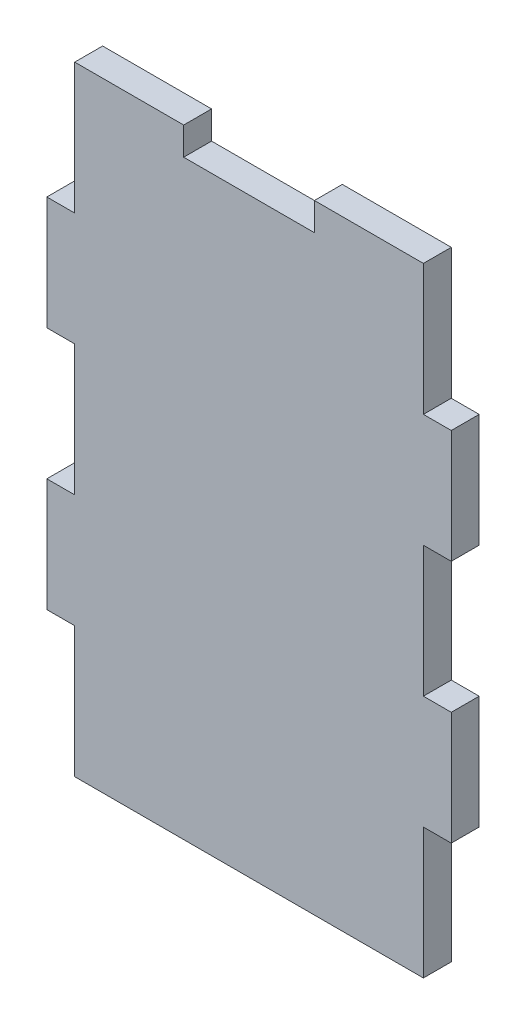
ISO-10303-21;
HEADER;
FILE_DESCRIPTION(('STEP AP214'),'2;1');
FILE_NAME('part.step','',(''),(''),'','','');
FILE_SCHEMA(('AUTOMOTIVE_DESIGN { 1 0 10303 214 1 1 1 1 }'));
ENDSEC;
DATA;
#1=APPLICATION_CONTEXT('core data for automotive mechanical design processes');
#2=APPLICATION_PROTOCOL_DEFINITION('international standard','automotive_design',2000,#1);
#3=PRODUCT_CONTEXT('',#1,'mechanical');
#4=PRODUCT('Part','Part','',(#3));
#5=PRODUCT_RELATED_PRODUCT_CATEGORY('part','',(#4));
#6=PRODUCT_DEFINITION_FORMATION('','',#4);
#7=PRODUCT_DEFINITION_CONTEXT('part definition',#1,'design');
#8=PRODUCT_DEFINITION('design','',#6,#7);
#9=PRODUCT_DEFINITION_SHAPE('','',#8);
#10=(LENGTH_UNIT() NAMED_UNIT(*) SI_UNIT(.MILLI.,.METRE.));
#11=(NAMED_UNIT(*) PLANE_ANGLE_UNIT() SI_UNIT($,.RADIAN.));
#12=(NAMED_UNIT(*) SI_UNIT($,.STERADIAN.) SOLID_ANGLE_UNIT());
#13=UNCERTAINTY_MEASURE_WITH_UNIT(LENGTH_MEASURE(1.E-05),#10,'distance_accuracy_value','');
#14=(GEOMETRIC_REPRESENTATION_CONTEXT(3) GLOBAL_UNCERTAINTY_ASSIGNED_CONTEXT((#13)) GLOBAL_UNIT_ASSIGNED_CONTEXT((#10,
#11,#12)) REPRESENTATION_CONTEXT('',''));
#15=CARTESIAN_POINT('',(0.,0.,0.));
#16=DIRECTION('',(0.,0.,1.));
#17=DIRECTION('',(1.,0.,0.));
#18=AXIS2_PLACEMENT_3D('',#15,#16,#17);
#19=CARTESIAN_POINT('',(0.,355.,16.));
#20=DIRECTION('',(0.,1.,0.));
#21=DIRECTION('',(0.,0.,1.));
#22=AXIS2_PLACEMENT_3D('',#19,#20,#21);
#23=PLANE('',#22);
#24=DIRECTION('',(1.,0.,0.));
#25=VECTOR('',#24,1.);
#26=CARTESIAN_POINT('',(0.,355.,0.));
#27=LINE('',#26,#25);
#28=CARTESIAN_POINT('',(153.5,355.,0.));
#29=VERTEX_POINT('',#28);
#30=CARTESIAN_POINT('',(216.,355.,0.));
#31=VERTEX_POINT('',#30);
#32=EDGE_CURVE('E229',#29,#31,#27,.T.);
#33=ORIENTED_EDGE('',*,*,#32,.F.);
#34=DIRECTION('',(0.,0.,-1.));
#35=VECTOR('',#34,1.);
#36=CARTESIAN_POINT('',(153.5,355.,16.));
#37=LINE('',#36,#35);
#38=CARTESIAN_POINT('',(153.5,355.,16.));
#39=VERTEX_POINT('',#38);
#40=EDGE_CURVE('E11',#39,#29,#37,.T.);
#41=ORIENTED_EDGE('',*,*,#40,.F.);
#42=DIRECTION('',(1.,0.,0.));
#43=VECTOR('',#42,1.);
#44=CARTESIAN_POINT('',(0.,355.,16.));
#45=LINE('',#44,#43);
#46=CARTESIAN_POINT('',(216.,355.,16.));
#47=VERTEX_POINT('',#46);
#48=EDGE_CURVE('E289',#39,#47,#45,.T.);
#49=ORIENTED_EDGE('',*,*,#48,.T.);
#50=DIRECTION('',(0.,0.,-1.));
#51=VECTOR('',#50,1.);
#52=CARTESIAN_POINT('',(216.,355.,16.));
#53=LINE('',#52,#51);
#54=EDGE_CURVE('E53',#47,#31,#53,.T.);
#55=ORIENTED_EDGE('',*,*,#54,.T.);
#56=EDGE_LOOP('',(#33,#41,#49,#55));
#57=FACE_BOUND('',#56,.T.);
#58=ADVANCED_FACE('F36',(#57),#23,.T.);
#59=CARTESIAN_POINT('',(153.499999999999,-2.66280053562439E-13,16.));
#60=DIRECTION('',(1.,0.,0.));
#61=DIRECTION('',(0.,1.,0.));
#62=AXIS2_PLACEMENT_3D('',#59,#60,#61);
#63=PLANE('',#62);
#64=DIRECTION('',(0.,-1.,0.));
#65=VECTOR('',#64,1.);
#66=CARTESIAN_POINT('',(153.499999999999,-2.66280053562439E-13,0.));
#67=LINE('',#66,#65);
#68=CARTESIAN_POINT('',(153.5,339.,0.));
#69=VERTEX_POINT('',#68);
#70=EDGE_CURVE('E231',#29,#69,#67,.T.);
#71=ORIENTED_EDGE('',*,*,#70,.T.);
#72=DIRECTION('',(0.,0.,-1.));
#73=VECTOR('',#72,1.);
#74=CARTESIAN_POINT('',(153.5,339.,16.));
#75=LINE('',#74,#73);
#76=CARTESIAN_POINT('',(153.5,339.,16.));
#77=VERTEX_POINT('',#76);
#78=EDGE_CURVE('E45',#77,#69,#75,.T.);
#79=ORIENTED_EDGE('',*,*,#78,.F.);
#80=DIRECTION('',(0.,-1.,0.));
#81=VECTOR('',#80,1.);
#82=CARTESIAN_POINT('',(153.499999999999,-2.66280053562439E-13,16.));
#83=LINE('',#82,#81);
#84=EDGE_CURVE('E353',#39,#77,#83,.T.);
#85=ORIENTED_EDGE('',*,*,#84,.F.);
#86=ORIENTED_EDGE('',*,*,#40,.T.);
#87=EDGE_LOOP('',(#71,#79,#85,#86));
#88=FACE_BOUND('',#87,.T.);
#89=ADVANCED_FACE('F38',(#88),#63,.F.);
#90=CARTESIAN_POINT('',(0.,339.,16.));
#91=DIRECTION('',(0.,1.,0.));
#92=DIRECTION('',(0.,0.,1.));
#93=AXIS2_PLACEMENT_3D('',#90,#91,#92);
#94=PLANE('',#93);
#95=DIRECTION('',(1.,0.,0.));
#96=VECTOR('',#95,1.);
#97=CARTESIAN_POINT('',(0.,339.,0.));
#98=LINE('',#97,#96);
#99=CARTESIAN_POINT('',(78.5,339.,0.));
#100=VERTEX_POINT('',#99);
#101=EDGE_CURVE('E235',#100,#69,#98,.T.);
#102=ORIENTED_EDGE('',*,*,#101,.F.);
#103=DIRECTION('',(0.,0.,-1.));
#104=VECTOR('',#103,1.);
#105=CARTESIAN_POINT('',(78.5,339.,16.));
#106=LINE('',#105,#104);
#107=CARTESIAN_POINT('',(78.5,339.,16.));
#108=VERTEX_POINT('',#107);
#109=EDGE_CURVE('E330',#108,#100,#106,.T.);
#110=ORIENTED_EDGE('',*,*,#109,.F.);
#111=DIRECTION('',(1.,0.,0.));
#112=VECTOR('',#111,1.);
#113=CARTESIAN_POINT('',(0.,339.,16.));
#114=LINE('',#113,#112);
#115=EDGE_CURVE('E337',#108,#77,#114,.T.);
#116=ORIENTED_EDGE('',*,*,#115,.T.);
#117=ORIENTED_EDGE('',*,*,#78,.T.);
#118=EDGE_LOOP('',(#102,#110,#116,#117));
#119=FACE_BOUND('',#118,.T.);
#120=ADVANCED_FACE('F335',(#119),#94,.T.);
#121=CARTESIAN_POINT('',(78.5,0.,16.));
#122=DIRECTION('',(1.,0.,0.));
#123=DIRECTION('',(0.,0.,-1.));
#124=AXIS2_PLACEMENT_3D('',#121,#122,#123);
#125=PLANE('',#124);
#126=DIRECTION('',(0.,-1.,0.));
#127=VECTOR('',#126,1.);
#128=CARTESIAN_POINT('',(78.5,0.,0.));
#129=LINE('',#128,#127);
#130=CARTESIAN_POINT('',(78.5,355.,0.));
#131=VERTEX_POINT('',#130);
#132=EDGE_CURVE('E238',#131,#100,#129,.T.);
#133=ORIENTED_EDGE('',*,*,#132,.F.);
#134=DIRECTION('',(0.,0.,-1.));
#135=VECTOR('',#134,1.);
#136=CARTESIAN_POINT('',(78.5,355.,16.));
#137=LINE('',#136,#135);
#138=CARTESIAN_POINT('',(78.5,355.,16.));
#139=VERTEX_POINT('',#138);
#140=EDGE_CURVE('E328',#139,#131,#137,.T.);
#141=ORIENTED_EDGE('',*,*,#140,.F.);
#142=DIRECTION('',(0.,-1.,0.));
#143=VECTOR('',#142,1.);
#144=CARTESIAN_POINT('',(78.5,0.,16.));
#145=LINE('',#144,#143);
#146=EDGE_CURVE('E350',#139,#108,#145,.T.);
#147=ORIENTED_EDGE('',*,*,#146,.T.);
#148=ORIENTED_EDGE('',*,*,#109,.T.);
#149=EDGE_LOOP('',(#133,#141,#147,#148));
#150=FACE_BOUND('',#149,.T.);
#151=ADVANCED_FACE('F347',(#150),#125,.T.);
#152=CARTESIAN_POINT('',(16.,355.,0.));
#153=VERTEX_POINT('',#152);
#154=EDGE_CURVE('E232',#153,#131,#27,.T.);
#155=ORIENTED_EDGE('',*,*,#154,.F.);
#156=DIRECTION('',(0.,0.,-1.));
#157=VECTOR('',#156,1.);
#158=CARTESIAN_POINT('',(16.,355.,16.));
#159=LINE('',#158,#157);
#160=CARTESIAN_POINT('',(16.,355.,16.));
#161=VERTEX_POINT('',#160);
#162=EDGE_CURVE('E326',#161,#153,#159,.T.);
#163=ORIENTED_EDGE('',*,*,#162,.F.);
#164=EDGE_CURVE('E355',#161,#139,#45,.T.);
#165=ORIENTED_EDGE('',*,*,#164,.T.);
#166=ORIENTED_EDGE('',*,*,#140,.T.);
#167=EDGE_LOOP('',(#155,#163,#165,#166));
#168=FACE_BOUND('',#167,.T.);
#169=ADVANCED_FACE('F408',(#168),#23,.T.);
#170=CARTESIAN_POINT('',(16.,0.,16.));
#171=DIRECTION('',(1.,0.,0.));
#172=DIRECTION('',(0.,1.,0.));
#173=AXIS2_PLACEMENT_3D('',#170,#171,#172);
#174=PLANE('',#173);
#175=DIRECTION('',(0.,-1.,0.));
#176=VECTOR('',#175,1.);
#177=CARTESIAN_POINT('',(16.,0.,0.));
#178=LINE('',#177,#176);
#179=CARTESIAN_POINT('',(16.,280.,0.));
#180=VERTEX_POINT('',#179);
#181=EDGE_CURVE('E241',#153,#180,#178,.T.);
#182=ORIENTED_EDGE('',*,*,#181,.T.);
#183=DIRECTION('',(0.,0.,-1.));
#184=VECTOR('',#183,1.);
#185=CARTESIAN_POINT('',(16.,280.,16.));
#186=LINE('',#185,#184);
#187=CARTESIAN_POINT('',(16.,280.,16.));
#188=VERTEX_POINT('',#187);
#189=EDGE_CURVE('E324',#188,#180,#186,.T.);
#190=ORIENTED_EDGE('',*,*,#189,.F.);
#191=DIRECTION('',(0.,-1.,0.));
#192=VECTOR('',#191,1.);
#193=CARTESIAN_POINT('',(16.,0.,16.));
#194=LINE('',#193,#192);
#195=EDGE_CURVE('E360',#161,#188,#194,.T.);
#196=ORIENTED_EDGE('',*,*,#195,.F.);
#197=ORIENTED_EDGE('',*,*,#162,.T.);
#198=EDGE_LOOP('',(#182,#190,#196,#197));
#199=FACE_BOUND('',#198,.T.);
#200=ADVANCED_FACE('F415',(#199),#174,.F.);
#201=CARTESIAN_POINT('',(0.,280.,16.));
#202=DIRECTION('',(0.,1.,0.));
#203=DIRECTION('',(0.,0.,1.));
#204=AXIS2_PLACEMENT_3D('',#201,#202,#203);
#205=PLANE('',#204);
#206=DIRECTION('',(1.,0.,0.));
#207=VECTOR('',#206,1.);
#208=CARTESIAN_POINT('',(0.,280.,0.));
#209=LINE('',#208,#207);
#210=CARTESIAN_POINT('',(0.,280.,0.));
#211=VERTEX_POINT('',#210);
#212=EDGE_CURVE('E244',#211,#180,#209,.T.);
#213=ORIENTED_EDGE('',*,*,#212,.F.);
#214=DIRECTION('',(0.,0.,-1.));
#215=VECTOR('',#214,1.);
#216=CARTESIAN_POINT('',(0.,280.,16.));
#217=LINE('',#216,#215);
#218=CARTESIAN_POINT('',(0.,280.,16.));
#219=VERTEX_POINT('',#218);
#220=EDGE_CURVE('E322',#219,#211,#217,.T.);
#221=ORIENTED_EDGE('',*,*,#220,.F.);
#222=DIRECTION('',(1.,0.,0.));
#223=VECTOR('',#222,1.);
#224=CARTESIAN_POINT('',(0.,280.,16.));
#225=LINE('',#224,#223);
#226=EDGE_CURVE('E362',#219,#188,#225,.T.);
#227=ORIENTED_EDGE('',*,*,#226,.T.);
#228=ORIENTED_EDGE('',*,*,#189,.T.);
#229=EDGE_LOOP('',(#213,#221,#227,#228));
#230=FACE_BOUND('',#229,.T.);
#231=ADVANCED_FACE('F421',(#230),#205,.T.);
#232=CARTESIAN_POINT('',(0.,0.,16.));
#233=DIRECTION('',(-1.,0.,0.));
#234=DIRECTION('',(0.,0.,1.));
#235=AXIS2_PLACEMENT_3D('',#232,#233,#234);
#236=PLANE('',#235);
#237=DIRECTION('',(0.,1.,0.));
#238=VECTOR('',#237,1.);
#239=CARTESIAN_POINT('',(0.,0.,0.));
#240=LINE('',#239,#238);
#241=CARTESIAN_POINT('',(0.,215.,0.));
#242=VERTEX_POINT('',#241);
#243=EDGE_CURVE('E247',#242,#211,#240,.T.);
#244=ORIENTED_EDGE('',*,*,#243,.F.);
#245=DIRECTION('',(0.,0.,-1.));
#246=VECTOR('',#245,1.);
#247=CARTESIAN_POINT('',(0.,215.,16.));
#248=LINE('',#247,#246);
#249=CARTESIAN_POINT('',(0.,215.,16.));
#250=VERTEX_POINT('',#249);
#251=EDGE_CURVE('E320',#250,#242,#248,.T.);
#252=ORIENTED_EDGE('',*,*,#251,.F.);
#253=DIRECTION('',(0.,1.,0.));
#254=VECTOR('',#253,1.);
#255=CARTESIAN_POINT('',(0.,0.,16.));
#256=LINE('',#255,#254);
#257=EDGE_CURVE('E365',#250,#219,#256,.T.);
#258=ORIENTED_EDGE('',*,*,#257,.T.);
#259=ORIENTED_EDGE('',*,*,#220,.T.);
#260=EDGE_LOOP('',(#244,#252,#258,#259));
#261=FACE_BOUND('',#260,.T.);
#262=ADVANCED_FACE('F431',(#261),#236,.T.);
#263=CARTESIAN_POINT('',(3.72965547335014E-13,215.,16.));
#264=DIRECTION('',(0.,1.,0.));
#265=DIRECTION('',(-1.,0.,0.));
#266=AXIS2_PLACEMENT_3D('',#263,#264,#265);
#267=PLANE('',#266);
#268=DIRECTION('',(1.,0.,0.));
#269=VECTOR('',#268,1.);
#270=CARTESIAN_POINT('',(3.72965547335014E-13,215.,0.));
#271=LINE('',#270,#269);
#272=CARTESIAN_POINT('',(16.,215.,0.));
#273=VERTEX_POINT('',#272);
#274=EDGE_CURVE('E250',#242,#273,#271,.T.);
#275=ORIENTED_EDGE('',*,*,#274,.T.);
#276=DIRECTION('',(0.,0.,-1.));
#277=VECTOR('',#276,1.);
#278=CARTESIAN_POINT('',(16.,215.,16.));
#279=LINE('',#278,#277);
#280=CARTESIAN_POINT('',(16.,215.,16.));
#281=VERTEX_POINT('',#280);
#282=EDGE_CURVE('E317',#281,#273,#279,.T.);
#283=ORIENTED_EDGE('',*,*,#282,.F.);
#284=DIRECTION('',(1.,0.,0.));
#285=VECTOR('',#284,1.);
#286=CARTESIAN_POINT('',(3.72965547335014E-13,215.,16.));
#287=LINE('',#286,#285);
#288=EDGE_CURVE('E368',#250,#281,#287,.T.);
#289=ORIENTED_EDGE('',*,*,#288,.F.);
#290=ORIENTED_EDGE('',*,*,#251,.T.);
#291=EDGE_LOOP('',(#275,#283,#289,#290));
#292=FACE_BOUND('',#291,.T.);
#293=ADVANCED_FACE('F438',(#292),#267,.F.);
#294=CARTESIAN_POINT('',(16.,0.,16.));
#295=DIRECTION('',(1.,0.,0.));
#296=DIRECTION('',(0.,1.,0.));
#297=AXIS2_PLACEMENT_3D('',#294,#295,#296);
#298=PLANE('',#297);
#299=DIRECTION('',(0.,-1.,0.));
#300=VECTOR('',#299,1.);
#301=CARTESIAN_POINT('',(16.,0.,0.));
#302=LINE('',#301,#300);
#303=CARTESIAN_POINT('',(16.,140.,0.));
#304=VERTEX_POINT('',#303);
#305=EDGE_CURVE('E253',#273,#304,#302,.T.);
#306=ORIENTED_EDGE('',*,*,#305,.T.);
#307=DIRECTION('',(0.,0.,-1.));
#308=VECTOR('',#307,1.);
#309=CARTESIAN_POINT('',(16.,140.,16.));
#310=LINE('',#309,#308);
#311=CARTESIAN_POINT('',(16.,140.,16.));
#312=VERTEX_POINT('',#311);
#313=EDGE_CURVE('E315',#312,#304,#310,.T.);
#314=ORIENTED_EDGE('',*,*,#313,.F.);
#315=DIRECTION('',(0.,-1.,0.));
#316=VECTOR('',#315,1.);
#317=CARTESIAN_POINT('',(16.,0.,16.));
#318=LINE('',#317,#316);
#319=EDGE_CURVE('E371',#281,#312,#318,.T.);
#320=ORIENTED_EDGE('',*,*,#319,.F.);
#321=ORIENTED_EDGE('',*,*,#282,.T.);
#322=EDGE_LOOP('',(#306,#314,#320,#321));
#323=FACE_BOUND('',#322,.T.);
#324=ADVANCED_FACE('F442',(#323),#298,.F.);
#325=CARTESIAN_POINT('',(0.,140.,16.));
#326=DIRECTION('',(0.,1.,0.));
#327=DIRECTION('',(0.,0.,1.));
#328=AXIS2_PLACEMENT_3D('',#325,#326,#327);
#329=PLANE('',#328);
#330=DIRECTION('',(1.,0.,0.));
#331=VECTOR('',#330,1.);
#332=CARTESIAN_POINT('',(0.,140.,0.));
#333=LINE('',#332,#331);
#334=CARTESIAN_POINT('',(0.,140.,0.));
#335=VERTEX_POINT('',#334);
#336=EDGE_CURVE('E256',#335,#304,#333,.T.);
#337=ORIENTED_EDGE('',*,*,#336,.F.);
#338=DIRECTION('',(0.,0.,-1.));
#339=VECTOR('',#338,1.);
#340=CARTESIAN_POINT('',(0.,140.,16.));
#341=LINE('',#340,#339);
#342=CARTESIAN_POINT('',(0.,140.,16.));
#343=VERTEX_POINT('',#342);
#344=EDGE_CURVE('E313',#343,#335,#341,.T.);
#345=ORIENTED_EDGE('',*,*,#344,.F.);
#346=DIRECTION('',(1.,0.,0.));
#347=VECTOR('',#346,1.);
#348=CARTESIAN_POINT('',(0.,140.,16.));
#349=LINE('',#348,#347);
#350=EDGE_CURVE('E373',#343,#312,#349,.T.);
#351=ORIENTED_EDGE('',*,*,#350,.T.);
#352=ORIENTED_EDGE('',*,*,#313,.T.);
#353=EDGE_LOOP('',(#337,#345,#351,#352));
#354=FACE_BOUND('',#353,.T.);
#355=ADVANCED_FACE('F445',(#354),#329,.T.);
#356=CARTESIAN_POINT('',(0.,75.,0.));
#357=VERTEX_POINT('',#356);
#358=EDGE_CURVE('E251',#357,#335,#240,.T.);
#359=ORIENTED_EDGE('',*,*,#358,.F.);
#360=DIRECTION('',(0.,0.,-1.));
#361=VECTOR('',#360,1.);
#362=CARTESIAN_POINT('',(0.,75.,16.));
#363=LINE('',#362,#361);
#364=CARTESIAN_POINT('',(0.,75.,16.));
#365=VERTEX_POINT('',#364);
#366=EDGE_CURVE('E311',#365,#357,#363,.T.);
#367=ORIENTED_EDGE('',*,*,#366,.F.);
#368=EDGE_CURVE('E369',#365,#343,#256,.T.);
#369=ORIENTED_EDGE('',*,*,#368,.T.);
#370=ORIENTED_EDGE('',*,*,#344,.T.);
#371=EDGE_LOOP('',(#359,#367,#369,#370));
#372=FACE_BOUND('',#371,.T.);
#373=ADVANCED_FACE('F450',(#372),#236,.T.);
#374=CARTESIAN_POINT('',(0.,75.,16.));
#375=DIRECTION('',(0.,1.,0.));
#376=DIRECTION('',(0.,0.,1.));
#377=AXIS2_PLACEMENT_3D('',#374,#375,#376);
#378=PLANE('',#377);
#379=DIRECTION('',(1.,0.,0.));
#380=VECTOR('',#379,1.);
#381=CARTESIAN_POINT('',(0.,75.,0.));
#382=LINE('',#381,#380);
#383=CARTESIAN_POINT('',(16.,75.,0.));
#384=VERTEX_POINT('',#383);
#385=EDGE_CURVE('E259',#357,#384,#382,.T.);
#386=ORIENTED_EDGE('',*,*,#385,.T.);
#387=DIRECTION('',(0.,0.,-1.));
#388=VECTOR('',#387,1.);
#389=CARTESIAN_POINT('',(16.,75.,16.));
#390=LINE('',#389,#388);
#391=CARTESIAN_POINT('',(16.,75.,16.));
#392=VERTEX_POINT('',#391);
#393=EDGE_CURVE('E309',#392,#384,#390,.T.);
#394=ORIENTED_EDGE('',*,*,#393,.F.);
#395=DIRECTION('',(1.,0.,0.));
#396=VECTOR('',#395,1.);
#397=CARTESIAN_POINT('',(0.,75.,16.));
#398=LINE('',#397,#396);
#399=EDGE_CURVE('E376',#365,#392,#398,.T.);
#400=ORIENTED_EDGE('',*,*,#399,.F.);
#401=ORIENTED_EDGE('',*,*,#366,.T.);
#402=EDGE_LOOP('',(#386,#394,#400,#401));
#403=FACE_BOUND('',#402,.T.);
#404=ADVANCED_FACE('F456',(#403),#378,.F.);
#405=CARTESIAN_POINT('',(16.,0.,16.));
#406=DIRECTION('',(-1.,0.,0.));
#407=DIRECTION('',(0.,0.,1.));
#408=AXIS2_PLACEMENT_3D('',#405,#406,#407);
#409=PLANE('',#408);
#410=DIRECTION('',(0.,1.,0.));
#411=VECTOR('',#410,1.);
#412=CARTESIAN_POINT('',(16.,0.,0.));
#413=LINE('',#412,#411);
#414=CARTESIAN_POINT('',(16.,0.,0.));
#415=VERTEX_POINT('',#414);
#416=EDGE_CURVE('E262',#415,#384,#413,.T.);
#417=ORIENTED_EDGE('',*,*,#416,.F.);
#418=DIRECTION('',(0.,0.,-1.));
#419=VECTOR('',#418,1.);
#420=CARTESIAN_POINT('',(16.,0.,16.));
#421=LINE('',#420,#419);
#422=CARTESIAN_POINT('',(16.,0.,16.));
#423=VERTEX_POINT('',#422);
#424=EDGE_CURVE('E307',#423,#415,#421,.T.);
#425=ORIENTED_EDGE('',*,*,#424,.F.);
#426=DIRECTION('',(0.,1.,0.));
#427=VECTOR('',#426,1.);
#428=CARTESIAN_POINT('',(16.,0.,16.));
#429=LINE('',#428,#427);
#430=EDGE_CURVE('E378',#423,#392,#429,.T.);
#431=ORIENTED_EDGE('',*,*,#430,.T.);
#432=ORIENTED_EDGE('',*,*,#393,.T.);
#433=EDGE_LOOP('',(#417,#425,#431,#432));
#434=FACE_BOUND('',#433,.T.);
#435=ADVANCED_FACE('F462',(#434),#409,.T.);
#436=CARTESIAN_POINT('',(0.,0.,16.));
#437=DIRECTION('',(0.,1.,0.));
#438=DIRECTION('',(-1.,0.,0.));
#439=AXIS2_PLACEMENT_3D('',#436,#437,#438);
#440=PLANE('',#439);
#441=DIRECTION('',(1.,0.,0.));
#442=VECTOR('',#441,1.);
#443=CARTESIAN_POINT('',(0.,0.,0.));
#444=LINE('',#443,#442);
#445=CARTESIAN_POINT('',(216.,2.06731183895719E-13,0.));
#446=VERTEX_POINT('',#445);
#447=EDGE_CURVE('E265',#415,#446,#444,.T.);
#448=ORIENTED_EDGE('',*,*,#447,.T.);
#449=DIRECTION('',(0.,0.,-1.));
#450=VECTOR('',#449,1.);
#451=CARTESIAN_POINT('',(216.,2.06731183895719E-13,16.));
#452=LINE('',#451,#450);
#453=CARTESIAN_POINT('',(216.,2.06731183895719E-13,16.));
#454=VERTEX_POINT('',#453);
#455=EDGE_CURVE('E304',#454,#446,#452,.T.);
#456=ORIENTED_EDGE('',*,*,#455,.F.);
#457=DIRECTION('',(1.,0.,0.));
#458=VECTOR('',#457,1.);
#459=CARTESIAN_POINT('',(0.,0.,16.));
#460=LINE('',#459,#458);
#461=EDGE_CURVE('E381',#423,#454,#460,.T.);
#462=ORIENTED_EDGE('',*,*,#461,.F.);
#463=ORIENTED_EDGE('',*,*,#424,.T.);
#464=EDGE_LOOP('',(#448,#456,#462,#463));
#465=FACE_BOUND('',#464,.T.);
#466=ADVANCED_FACE('F465',(#465),#440,.F.);
#467=CARTESIAN_POINT('',(216.,0.,16.));
#468=DIRECTION('',(-1.,0.,0.));
#469=DIRECTION('',(0.,0.,1.));
#470=AXIS2_PLACEMENT_3D('',#467,#468,#469);
#471=PLANE('',#470);
#472=DIRECTION('',(0.,1.,0.));
#473=VECTOR('',#472,1.);
#474=CARTESIAN_POINT('',(216.,0.,0.));
#475=LINE('',#474,#473);
#476=CARTESIAN_POINT('',(216.,75.0000000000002,0.));
#477=VERTEX_POINT('',#476);
#478=EDGE_CURVE('E267',#446,#477,#475,.T.);
#479=ORIENTED_EDGE('',*,*,#478,.T.);
#480=DIRECTION('',(0.,0.,-1.));
#481=VECTOR('',#480,1.);
#482=CARTESIAN_POINT('',(216.,75.0000000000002,16.));
#483=LINE('',#482,#481);
#484=CARTESIAN_POINT('',(216.,75.0000000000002,16.));
#485=VERTEX_POINT('',#484);
#486=EDGE_CURVE('E302',#485,#477,#483,.T.);
#487=ORIENTED_EDGE('',*,*,#486,.F.);
#488=DIRECTION('',(0.,1.,0.));
#489=VECTOR('',#488,1.);
#490=CARTESIAN_POINT('',(216.,0.,16.));
#491=LINE('',#490,#489);
#492=EDGE_CURVE('E383',#454,#485,#491,.T.);
#493=ORIENTED_EDGE('',*,*,#492,.F.);
#494=ORIENTED_EDGE('',*,*,#455,.T.);
#495=EDGE_LOOP('',(#479,#487,#493,#494));
#496=FACE_BOUND('',#495,.T.);
#497=ADVANCED_FACE('F470',(#496),#471,.F.);
#498=CARTESIAN_POINT('',(0.,75.0000000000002,16.));
#499=DIRECTION('',(0.,-1.,0.));
#500=DIRECTION('',(0.,0.,-1.));
#501=AXIS2_PLACEMENT_3D('',#498,#499,#500);
#502=PLANE('',#501);
#503=DIRECTION('',(-1.,0.,0.));
#504=VECTOR('',#503,1.);
#505=CARTESIAN_POINT('',(0.,75.0000000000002,0.));
#506=LINE('',#505,#504);
#507=CARTESIAN_POINT('',(232.,75.0000000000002,0.));
#508=VERTEX_POINT('',#507);
#509=EDGE_CURVE('E270',#508,#477,#506,.T.);
#510=ORIENTED_EDGE('',*,*,#509,.F.);
#511=DIRECTION('',(0.,0.,-1.));
#512=VECTOR('',#511,1.);
#513=CARTESIAN_POINT('',(232.,75.0000000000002,16.));
#514=LINE('',#513,#512);
#515=CARTESIAN_POINT('',(232.,75.0000000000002,16.));
#516=VERTEX_POINT('',#515);
#517=EDGE_CURVE('E300',#516,#508,#514,.T.);
#518=ORIENTED_EDGE('',*,*,#517,.F.);
#519=DIRECTION('',(-1.,0.,0.));
#520=VECTOR('',#519,1.);
#521=CARTESIAN_POINT('',(0.,75.0000000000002,16.));
#522=LINE('',#521,#520);
#523=EDGE_CURVE('E385',#516,#485,#522,.T.);
#524=ORIENTED_EDGE('',*,*,#523,.T.);
#525=ORIENTED_EDGE('',*,*,#486,.T.);
#526=EDGE_LOOP('',(#510,#518,#524,#525));
#527=FACE_BOUND('',#526,.T.);
#528=ADVANCED_FACE('F476',(#527),#502,.T.);
#529=CARTESIAN_POINT('',(232.,0.,16.));
#530=DIRECTION('',(-1.,0.,0.));
#531=DIRECTION('',(0.,0.,1.));
#532=AXIS2_PLACEMENT_3D('',#529,#530,#531);
#533=PLANE('',#532);
#534=DIRECTION('',(0.,1.,0.));
#535=VECTOR('',#534,1.);
#536=CARTESIAN_POINT('',(232.,0.,0.));
#537=LINE('',#536,#535);
#538=CARTESIAN_POINT('',(232.,140.,0.));
#539=VERTEX_POINT('',#538);
#540=EDGE_CURVE('E273',#508,#539,#537,.T.);
#541=ORIENTED_EDGE('',*,*,#540,.T.);
#542=DIRECTION('',(0.,0.,-1.));
#543=VECTOR('',#542,1.);
#544=CARTESIAN_POINT('',(232.,140.,16.));
#545=LINE('',#544,#543);
#546=CARTESIAN_POINT('',(232.,140.,16.));
#547=VERTEX_POINT('',#546);
#548=EDGE_CURVE('E297',#547,#539,#545,.T.);
#549=ORIENTED_EDGE('',*,*,#548,.F.);
#550=DIRECTION('',(0.,1.,0.));
#551=VECTOR('',#550,1.);
#552=CARTESIAN_POINT('',(232.,0.,16.));
#553=LINE('',#552,#551);
#554=EDGE_CURVE('E212',#516,#547,#553,.T.);
#555=ORIENTED_EDGE('',*,*,#554,.F.);
#556=ORIENTED_EDGE('',*,*,#517,.T.);
#557=EDGE_LOOP('',(#541,#549,#555,#556));
#558=FACE_BOUND('',#557,.T.);
#559=ADVANCED_FACE('F479',(#558),#533,.F.);
#560=CARTESIAN_POINT('',(0.,140.,16.));
#561=DIRECTION('',(0.,-1.,0.));
#562=DIRECTION('',(0.,0.,-1.));
#563=AXIS2_PLACEMENT_3D('',#560,#561,#562);
#564=PLANE('',#563);
#565=DIRECTION('',(-1.,0.,0.));
#566=VECTOR('',#565,1.);
#567=CARTESIAN_POINT('',(0.,140.,0.));
#568=LINE('',#567,#566);
#569=CARTESIAN_POINT('',(216.,140.,0.));
#570=VERTEX_POINT('',#569);
#571=EDGE_CURVE('E275',#539,#570,#568,.T.);
#572=ORIENTED_EDGE('',*,*,#571,.T.);
#573=DIRECTION('',(0.,0.,-1.));
#574=VECTOR('',#573,1.);
#575=CARTESIAN_POINT('',(216.,140.,16.));
#576=LINE('',#575,#574);
#577=CARTESIAN_POINT('',(216.,140.,16.));
#578=VERTEX_POINT('',#577);
#579=EDGE_CURVE('E295',#578,#570,#576,.T.);
#580=ORIENTED_EDGE('',*,*,#579,.F.);
#581=DIRECTION('',(-1.,0.,0.));
#582=VECTOR('',#581,1.);
#583=CARTESIAN_POINT('',(0.,140.,16.));
#584=LINE('',#583,#582);
#585=EDGE_CURVE('E388',#547,#578,#584,.T.);
#586=ORIENTED_EDGE('',*,*,#585,.F.);
#587=ORIENTED_EDGE('',*,*,#548,.T.);
#588=EDGE_LOOP('',(#572,#580,#586,#587));
#589=FACE_BOUND('',#588,.T.);
#590=ADVANCED_FACE('F484',(#589),#564,.F.);
#591=CARTESIAN_POINT('',(216.,0.,16.));
#592=DIRECTION('',(1.,0.,0.));
#593=DIRECTION('',(0.,0.,-1.));
#594=AXIS2_PLACEMENT_3D('',#591,#592,#593);
#595=PLANE('',#594);
#596=DIRECTION('',(0.,-1.,0.));
#597=VECTOR('',#596,1.);
#598=CARTESIAN_POINT('',(216.,0.,0.));
#599=LINE('',#598,#597);
#600=CARTESIAN_POINT('',(216.,215.,0.));
#601=VERTEX_POINT('',#600);
#602=EDGE_CURVE('E278',#601,#570,#599,.T.);
#603=ORIENTED_EDGE('',*,*,#602,.F.);
#604=DIRECTION('',(0.,0.,-1.));
#605=VECTOR('',#604,1.);
#606=CARTESIAN_POINT('',(216.,215.,16.));
#607=LINE('',#606,#605);
#608=CARTESIAN_POINT('',(216.,215.,16.));
#609=VERTEX_POINT('',#608);
#610=EDGE_CURVE('E293',#609,#601,#607,.T.);
#611=ORIENTED_EDGE('',*,*,#610,.F.);
#612=DIRECTION('',(0.,-1.,0.));
#613=VECTOR('',#612,1.);
#614=CARTESIAN_POINT('',(216.,0.,16.));
#615=LINE('',#614,#613);
#616=EDGE_CURVE('E389',#609,#578,#615,.T.);
#617=ORIENTED_EDGE('',*,*,#616,.T.);
#618=ORIENTED_EDGE('',*,*,#579,.T.);
#619=EDGE_LOOP('',(#603,#611,#617,#618));
#620=FACE_BOUND('',#619,.T.);
#621=ADVANCED_FACE('F485',(#620),#595,.T.);
#622=CARTESIAN_POINT('',(-3.72965547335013E-13,215.,16.));
#623=DIRECTION('',(0.,-1.,0.));
#624=DIRECTION('',(1.,0.,0.));
#625=AXIS2_PLACEMENT_3D('',#622,#623,#624);
#626=PLANE('',#625);
#627=DIRECTION('',(-1.,0.,0.));
#628=VECTOR('',#627,1.);
#629=CARTESIAN_POINT('',(-3.72965547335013E-13,215.,0.));
#630=LINE('',#629,#628);
#631=CARTESIAN_POINT('',(232.,215.,0.));
#632=VERTEX_POINT('',#631);
#633=EDGE_CURVE('E281',#632,#601,#630,.T.);
#634=ORIENTED_EDGE('',*,*,#633,.F.);
#635=DIRECTION('',(0.,0.,-1.));
#636=VECTOR('',#635,1.);
#637=CARTESIAN_POINT('',(232.,215.,16.));
#638=LINE('',#637,#636);
#639=CARTESIAN_POINT('',(232.,215.,16.));
#640=VERTEX_POINT('',#639);
#641=EDGE_CURVE('E220',#640,#632,#638,.T.);
#642=ORIENTED_EDGE('',*,*,#641,.F.);
#643=DIRECTION('',(-1.,0.,0.));
#644=VECTOR('',#643,1.);
#645=CARTESIAN_POINT('',(-3.72965547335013E-13,215.,16.));
#646=LINE('',#645,#644);
#647=EDGE_CURVE('E209',#640,#609,#646,.T.);
#648=ORIENTED_EDGE('',*,*,#647,.T.);
#649=ORIENTED_EDGE('',*,*,#610,.T.);
#650=EDGE_LOOP('',(#634,#642,#648,#649));
#651=FACE_BOUND('',#650,.T.);
#652=ADVANCED_FACE('F394',(#651),#626,.T.);
#653=CARTESIAN_POINT('',(232.,280.,0.));
#654=VERTEX_POINT('',#653);
#655=EDGE_CURVE('E217',#632,#654,#537,.T.);
#656=ORIENTED_EDGE('',*,*,#655,.T.);
#657=DIRECTION('',(0.,0.,-1.));
#658=VECTOR('',#657,1.);
#659=CARTESIAN_POINT('',(232.,280.,16.));
#660=LINE('',#659,#658);
#661=CARTESIAN_POINT('',(232.,280.,16.));
#662=VERTEX_POINT('',#661);
#663=EDGE_CURVE('E214',#662,#654,#660,.T.);
#664=ORIENTED_EDGE('',*,*,#663,.F.);
#665=EDGE_CURVE('E200',#640,#662,#553,.T.);
#666=ORIENTED_EDGE('',*,*,#665,.F.);
#667=ORIENTED_EDGE('',*,*,#641,.T.);
#668=EDGE_LOOP('',(#656,#664,#666,#667));
#669=FACE_BOUND('',#668,.T.);
#670=ADVANCED_FACE('F215',(#669),#533,.F.);
#671=CARTESIAN_POINT('',(0.,280.,16.));
#672=DIRECTION('',(0.,-1.,0.));
#673=DIRECTION('',(0.,0.,-1.));
#674=AXIS2_PLACEMENT_3D('',#671,#672,#673);
#675=PLANE('',#674);
#676=DIRECTION('',(-1.,0.,0.));
#677=VECTOR('',#676,1.);
#678=CARTESIAN_POINT('',(0.,280.,0.));
#679=LINE('',#678,#677);
#680=CARTESIAN_POINT('',(216.,280.,0.));
#681=VERTEX_POINT('',#680);
#682=EDGE_CURVE('E284',#654,#681,#679,.T.);
#683=ORIENTED_EDGE('',*,*,#682,.T.);
#684=DIRECTION('',(0.,0.,-1.));
#685=VECTOR('',#684,1.);
#686=CARTESIAN_POINT('',(216.,280.,16.));
#687=LINE('',#686,#685);
#688=CARTESIAN_POINT('',(216.,280.,16.));
#689=VERTEX_POINT('',#688);
#690=EDGE_CURVE('E127',#689,#681,#687,.T.);
#691=ORIENTED_EDGE('',*,*,#690,.F.);
#692=DIRECTION('',(-1.,0.,0.));
#693=VECTOR('',#692,1.);
#694=CARTESIAN_POINT('',(0.,280.,16.));
#695=LINE('',#694,#693);
#696=EDGE_CURVE('E206',#662,#689,#695,.T.);
#697=ORIENTED_EDGE('',*,*,#696,.F.);
#698=ORIENTED_EDGE('',*,*,#663,.T.);
#699=EDGE_LOOP('',(#683,#691,#697,#698));
#700=FACE_BOUND('',#699,.T.);
#701=ADVANCED_FACE('F222',(#700),#675,.F.);
#702=CARTESIAN_POINT('',(216.,0.,16.));
#703=DIRECTION('',(1.,0.,0.));
#704=DIRECTION('',(0.,0.,-1.));
#705=AXIS2_PLACEMENT_3D('',#702,#703,#704);
#706=PLANE('',#705);
#707=DIRECTION('',(0.,-1.,0.));
#708=VECTOR('',#707,1.);
#709=CARTESIAN_POINT('',(216.,0.,0.));
#710=LINE('',#709,#708);
#711=EDGE_CURVE('E286',#31,#681,#710,.T.);
#712=ORIENTED_EDGE('',*,*,#711,.F.);
#713=ORIENTED_EDGE('',*,*,#54,.F.);
#714=DIRECTION('',(0.,-1.,0.));
#715=VECTOR('',#714,1.);
#716=CARTESIAN_POINT('',(216.,0.,16.));
#717=LINE('',#716,#715);
#718=EDGE_CURVE('E223',#47,#689,#717,.T.);
#719=ORIENTED_EDGE('',*,*,#718,.T.);
#720=ORIENTED_EDGE('',*,*,#690,.T.);
#721=EDGE_LOOP('',(#712,#713,#719,#720));
#722=FACE_BOUND('',#721,.T.);
#723=ADVANCED_FACE('F396',(#722),#706,.T.);
#724=CARTESIAN_POINT('',(0.,0.,16.));
#725=DIRECTION('',(0.,0.,1.));
#726=DIRECTION('',(1.,0.,0.));
#727=AXIS2_PLACEMENT_3D('',#724,#725,#726);
#728=PLANE('',#727);
#729=ORIENTED_EDGE('',*,*,#48,.F.);
#730=ORIENTED_EDGE('',*,*,#84,.T.);
#731=ORIENTED_EDGE('',*,*,#115,.F.);
#732=ORIENTED_EDGE('',*,*,#146,.F.);
#733=ORIENTED_EDGE('',*,*,#164,.F.);
#734=ORIENTED_EDGE('',*,*,#195,.T.);
#735=ORIENTED_EDGE('',*,*,#226,.F.);
#736=ORIENTED_EDGE('',*,*,#257,.F.);
#737=ORIENTED_EDGE('',*,*,#288,.T.);
#738=ORIENTED_EDGE('',*,*,#319,.T.);
#739=ORIENTED_EDGE('',*,*,#350,.F.);
#740=ORIENTED_EDGE('',*,*,#368,.F.);
#741=ORIENTED_EDGE('',*,*,#399,.T.);
#742=ORIENTED_EDGE('',*,*,#430,.F.);
#743=ORIENTED_EDGE('',*,*,#461,.T.);
#744=ORIENTED_EDGE('',*,*,#492,.T.);
#745=ORIENTED_EDGE('',*,*,#523,.F.);
#746=ORIENTED_EDGE('',*,*,#554,.T.);
#747=ORIENTED_EDGE('',*,*,#585,.T.);
#748=ORIENTED_EDGE('',*,*,#616,.F.);
#749=ORIENTED_EDGE('',*,*,#647,.F.);
#750=ORIENTED_EDGE('',*,*,#665,.T.);
#751=ORIENTED_EDGE('',*,*,#696,.T.);
#752=ORIENTED_EDGE('',*,*,#718,.F.);
#753=EDGE_LOOP('',(#729,#730,#731,#732,#733,#734,#735,#736,#737,#738,#739,#740,#741,#742,#743,
#744,#745,#746,#747,#748,#749,#750,#751,#752));
#754=FACE_BOUND('',#753,.T.);
#755=ADVANCED_FACE('F203',(#754),#728,.T.);
#756=CARTESIAN_POINT('',(0.,0.,0.));
#757=DIRECTION('',(0.,0.,1.));
#758=DIRECTION('',(1.,0.,0.));
#759=AXIS2_PLACEMENT_3D('',#756,#757,#758);
#760=PLANE('',#759);
#761=ORIENTED_EDGE('',*,*,#32,.T.);
#762=ORIENTED_EDGE('',*,*,#711,.T.);
#763=ORIENTED_EDGE('',*,*,#682,.F.);
#764=ORIENTED_EDGE('',*,*,#655,.F.);
#765=ORIENTED_EDGE('',*,*,#633,.T.);
#766=ORIENTED_EDGE('',*,*,#602,.T.);
#767=ORIENTED_EDGE('',*,*,#571,.F.);
#768=ORIENTED_EDGE('',*,*,#540,.F.);
#769=ORIENTED_EDGE('',*,*,#509,.T.);
#770=ORIENTED_EDGE('',*,*,#478,.F.);
#771=ORIENTED_EDGE('',*,*,#447,.F.);
#772=ORIENTED_EDGE('',*,*,#416,.T.);
#773=ORIENTED_EDGE('',*,*,#385,.F.);
#774=ORIENTED_EDGE('',*,*,#358,.T.);
#775=ORIENTED_EDGE('',*,*,#336,.T.);
#776=ORIENTED_EDGE('',*,*,#305,.F.);
#777=ORIENTED_EDGE('',*,*,#274,.F.);
#778=ORIENTED_EDGE('',*,*,#243,.T.);
#779=ORIENTED_EDGE('',*,*,#212,.T.);
#780=ORIENTED_EDGE('',*,*,#181,.F.);
#781=ORIENTED_EDGE('',*,*,#154,.T.);
#782=ORIENTED_EDGE('',*,*,#132,.T.);
#783=ORIENTED_EDGE('',*,*,#101,.T.);
#784=ORIENTED_EDGE('',*,*,#70,.F.);
#785=EDGE_LOOP('',(#761,#762,#763,#764,#765,#766,#767,#768,#769,#770,#771,#772,#773,#774,#775,
#776,#777,#778,#779,#780,#781,#782,#783,#784));
#786=FACE_BOUND('',#785,.T.);
#787=ADVANCED_FACE('F341',(#786),#760,.F.);
#788=CLOSED_SHELL('',(#58,#89,#120,#151,#169,#200,#231,#262,#293,#324,#355,#373,#404,#435,#466,
#497,#528,#559,#590,#621,#652,#670,#701,#723,#755,#787));
#789=MANIFOLD_SOLID_BREP('B2',#788);
#790=ADVANCED_BREP_SHAPE_REPRESENTATION('',(#18,#789),#14);
#791=SHAPE_DEFINITION_REPRESENTATION(#9,#790);
ENDSEC;
END-ISO-10303-21;
